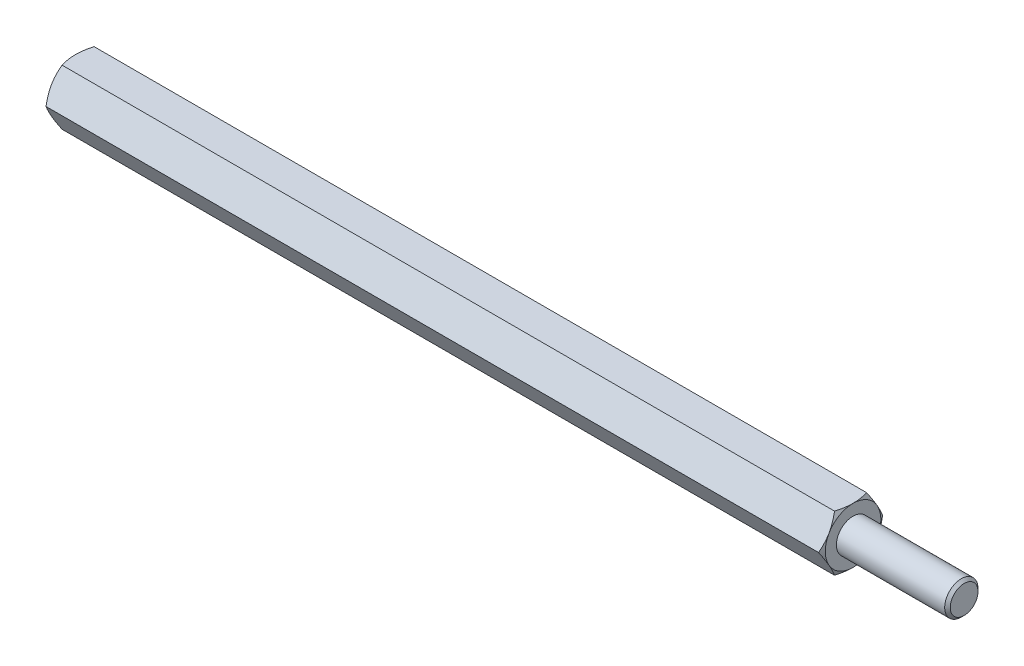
ISO-10303-21;
HEADER;
FILE_DESCRIPTION(('STEP AP214'),'2;1');
FILE_NAME('part.step','',(''),(''),'','','');
FILE_SCHEMA(('AUTOMOTIVE_DESIGN { 1 0 10303 214 1 1 1 1 }'));
ENDSEC;
DATA;
#1=APPLICATION_CONTEXT('core data for automotive mechanical design processes');
#2=APPLICATION_PROTOCOL_DEFINITION('international standard','automotive_design',2000,#1);
#3=PRODUCT_CONTEXT('',#1,'mechanical');
#4=PRODUCT('Part','Part','',(#3));
#5=PRODUCT_RELATED_PRODUCT_CATEGORY('part','',(#4));
#6=PRODUCT_DEFINITION_FORMATION('','',#4);
#7=PRODUCT_DEFINITION_CONTEXT('part definition',#1,'design');
#8=PRODUCT_DEFINITION('design','',#6,#7);
#9=PRODUCT_DEFINITION_SHAPE('','',#8);
#10=(LENGTH_UNIT() NAMED_UNIT(*) SI_UNIT(.MILLI.,.METRE.));
#11=(NAMED_UNIT(*) PLANE_ANGLE_UNIT() SI_UNIT($,.RADIAN.));
#12=(NAMED_UNIT(*) SI_UNIT($,.STERADIAN.) SOLID_ANGLE_UNIT());
#13=UNCERTAINTY_MEASURE_WITH_UNIT(LENGTH_MEASURE(1.E-05),#10,'distance_accuracy_value','');
#14=(GEOMETRIC_REPRESENTATION_CONTEXT(3) GLOBAL_UNCERTAINTY_ASSIGNED_CONTEXT((#13)) GLOBAL_UNIT_ASSIGNED_CONTEXT((#10,
#11,#12)) REPRESENTATION_CONTEXT('',''));
#15=CARTESIAN_POINT('',(0.,0.,0.));
#16=DIRECTION('',(0.,0.,1.));
#17=DIRECTION('',(1.,0.,0.));
#18=AXIS2_PLACEMENT_3D('',#15,#16,#17);
#19=CARTESIAN_POINT('',(35.,2.5,-1.44337567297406));
#20=DIRECTION('',(1.,0.,0.));
#21=DIRECTION('',(0.,0.,-1.));
#22=AXIS2_PLACEMENT_3D('',#19,#20,#21);
#23=PLANE('',#22);
#24=CARTESIAN_POINT('',(35.,0.,0.));
#25=DIRECTION('',(1.,0.,0.));
#26=DIRECTION('',(0.,0.,-1.));
#27=AXIS2_PLACEMENT_3D('',#24,#25,#26);
#28=CIRCLE('',#27,2.50000000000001);
#29=CARTESIAN_POINT('',(35.,-1.25000000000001,-2.16506350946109));
#30=VERTEX_POINT('',#29);
#31=CARTESIAN_POINT('',(35.,1.25,-2.1650635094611));
#32=VERTEX_POINT('',#31);
#33=EDGE_CURVE('E288',#30,#32,#28,.T.);
#34=ORIENTED_EDGE('',*,*,#33,.T.);
#35=CARTESIAN_POINT('',(35.,2.5,0.));
#36=VERTEX_POINT('',#35);
#37=EDGE_CURVE('E53',#32,#36,#28,.T.);
#38=ORIENTED_EDGE('',*,*,#37,.T.);
#39=CARTESIAN_POINT('',(35.,1.25,2.1650635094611));
#40=VERTEX_POINT('',#39);
#41=EDGE_CURVE('E296',#36,#40,#28,.T.);
#42=ORIENTED_EDGE('',*,*,#41,.T.);
#43=CARTESIAN_POINT('',(35.,-1.25000000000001,2.1650635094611));
#44=VERTEX_POINT('',#43);
#45=EDGE_CURVE('E301',#40,#44,#28,.T.);
#46=ORIENTED_EDGE('',*,*,#45,.T.);
#47=CARTESIAN_POINT('',(35.,0.,0.));
#48=DIRECTION('',(-1.,0.,0.));
#49=DIRECTION('',(0.,-1.,0.));
#50=AXIS2_PLACEMENT_3D('',#47,#48,#49);
#51=CIRCLE('',#50,2.50000000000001);
#52=CARTESIAN_POINT('',(35.,-2.50000000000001,0.));
#53=VERTEX_POINT('',#52);
#54=EDGE_CURVE('E193',#53,#44,#51,.T.);
#55=ORIENTED_EDGE('',*,*,#54,.F.);
#56=EDGE_CURVE('E61',#53,#30,#28,.T.);
#57=ORIENTED_EDGE('',*,*,#56,.T.);
#58=EDGE_LOOP('',(#34,#38,#42,#46,#55,#57));
#59=FACE_BOUND('',#58,.T.);
#60=CARTESIAN_POINT('',(35.,0.,0.));
#61=DIRECTION('',(1.,0.,0.));
#62=DIRECTION('',(0.,0.,-1.));
#63=AXIS2_PLACEMENT_3D('',#60,#61,#62);
#64=CIRCLE('',#63,1.5);
#65=CARTESIAN_POINT('',(35.,0.,-1.5));
#66=VERTEX_POINT('',#65);
#67=EDGE_CURVE('E311',#66,#66,#64,.T.);
#68=ORIENTED_EDGE('',*,*,#67,.F.);
#69=EDGE_LOOP('',(#68));
#70=FACE_BOUND('',#69,.T.);
#71=ADVANCED_FACE('F37',(#59,#70),#23,.T.);
#72=CARTESIAN_POINT('',(35.,0.,-2.88675134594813));
#73=DIRECTION('',(0.,-0.5,0.866025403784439));
#74=DIRECTION('',(0.,-0.866025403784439,-0.5));
#75=AXIS2_PLACEMENT_3D('',#72,#73,#74);
#76=PLANE('',#75);
#77=CARTESIAN_POINT('',(34.7766423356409,-0.000199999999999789,-2.88686681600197));
#78=CARTESIAN_POINT('',(34.8132783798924,0.109663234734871,-2.82343724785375));
#79=CARTESIAN_POINT('',(34.846597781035,0.220474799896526,-2.75946016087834));
#80=CARTESIAN_POINT('',(34.9047577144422,0.44401683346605,-2.63039810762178));
#81=CARTESIAN_POINT('',(34.9295776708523,0.556751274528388,-2.5653108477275));
#82=CARTESIAN_POINT('',(34.968214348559,0.780822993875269,-2.43594298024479));
#83=CARTESIAN_POINT('',(34.9822882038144,0.892125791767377,-2.37168227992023));
#84=CARTESIAN_POINT('',(34.9990908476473,1.11525522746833,-2.24285844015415));
#85=CARTESIAN_POINT('',(35.0018335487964,1.22708105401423,-2.17829576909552));
#86=CARTESIAN_POINT('',(34.996134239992,1.43604197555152,-2.05765212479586));
#87=CARTESIAN_POINT('',(34.9890916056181,1.53320831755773,-2.0015531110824));
#88=CARTESIAN_POINT('',(34.9667685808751,1.726907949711,-1.88972057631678));
#89=CARTESIAN_POINT('',(34.9514805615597,1.82344056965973,-1.8339874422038));
#90=CARTESIAN_POINT('',(34.9132609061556,2.01753972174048,-1.7219242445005));
#91=CARTESIAN_POINT('',(34.8901672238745,2.11508168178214,-1.66560836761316));
#92=CARTESIAN_POINT('',(34.8377533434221,2.30871060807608,-1.55381665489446));
#93=CARTESIAN_POINT('',(34.8084454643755,2.40480005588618,-1.49833938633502));
#94=CARTESIAN_POINT('',(34.7766423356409,2.5002,-1.44326020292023));
#95=B_SPLINE_CURVE_WITH_KNOTS('',3,(#77,#78,#79,#80,#81,#82,#83,#84,#85,#86,#87,#88,#89,#90,#91,
#92,#93,#94),.UNSPECIFIED.,.F.,.F.,(4,2,2,2,2,2,2,2,4),(0.,0.396285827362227,0.793524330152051,
1.18093086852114,1.56786160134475,1.90479741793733,2.24204551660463,2.58677531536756,
2.93082800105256),.UNSPECIFIED.);
#96=CARTESIAN_POINT('',(34.7767090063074,0.,-2.88675134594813));
#97=VERTEX_POINT('',#96);
#98=EDGE_CURVE('E317',#97,#32,#95,.T.);
#99=ORIENTED_EDGE('',*,*,#98,.F.);
#100=DIRECTION('',(-1.,0.,0.));
#101=VECTOR('',#100,1.);
#102=CARTESIAN_POINT('',(35.,0.,-2.88675134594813));
#103=LINE('',#102,#101);
#104=CARTESIAN_POINT('',(-34.7767090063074,0.,-2.88675134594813));
#105=VERTEX_POINT('',#104);
#106=EDGE_CURVE('E264',#97,#105,#103,.T.);
#107=ORIENTED_EDGE('',*,*,#106,.T.);
#108=CARTESIAN_POINT('',(-34.7766423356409,2.5002,-1.44326020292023));
#109=CARTESIAN_POINT('',(-34.8132783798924,2.39033676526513,-1.50668977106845));
#110=CARTESIAN_POINT('',(-34.846597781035,2.27952520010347,-1.57066685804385));
#111=CARTESIAN_POINT('',(-34.9047577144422,2.05598316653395,-1.69972891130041));
#112=CARTESIAN_POINT('',(-34.9295776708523,1.94324872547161,-1.7648161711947));
#113=CARTESIAN_POINT('',(-34.968214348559,1.71917700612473,-1.8941840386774));
#114=CARTESIAN_POINT('',(-34.9822882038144,1.60787420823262,-1.95844473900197));
#115=CARTESIAN_POINT('',(-34.9990908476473,1.38474477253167,-2.08726857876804));
#116=CARTESIAN_POINT('',(-35.0018335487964,1.27291894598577,-2.15183124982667));
#117=CARTESIAN_POINT('',(-34.996134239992,1.06395802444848,-2.27247489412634));
#118=CARTESIAN_POINT('',(-34.9890916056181,0.966791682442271,-2.32857390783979));
#119=CARTESIAN_POINT('',(-34.9667685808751,0.773092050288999,-2.44040644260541));
#120=CARTESIAN_POINT('',(-34.9514805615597,0.676559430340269,-2.49613957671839));
#121=CARTESIAN_POINT('',(-34.9132609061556,0.482460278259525,-2.60820277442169));
#122=CARTESIAN_POINT('',(-34.8901672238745,0.384918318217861,-2.66451865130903));
#123=CARTESIAN_POINT('',(-34.8377533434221,0.191289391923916,-2.77631036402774));
#124=CARTESIAN_POINT('',(-34.8084454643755,0.0951999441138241,-2.83178763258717));
#125=CARTESIAN_POINT('',(-34.7766423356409,-0.000199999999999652,-2.88686681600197));
#126=B_SPLINE_CURVE_WITH_KNOTS('',3,(#108,#109,#110,#111,#112,#113,#114,#115,#116,#117,#118,
#119,#120,#121,#122,#123,#124,#125),.UNSPECIFIED.,.F.,.F.,(4,2,2,2,2,2,2,2,4),(0.,
0.396285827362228,0.79352433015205,1.18093086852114,1.56786160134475,1.90479741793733,
2.24204551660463,2.58677531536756,2.93082800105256),.UNSPECIFIED.);
#127=CARTESIAN_POINT('',(-35.,1.25,-2.1650635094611));
#128=VERTEX_POINT('',#127);
#129=EDGE_CURVE('E345',#128,#105,#126,.T.);
#130=ORIENTED_EDGE('',*,*,#129,.F.);
#131=CARTESIAN_POINT('',(-34.7767090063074,2.5,-1.44337567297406));
#132=VERTEX_POINT('',#131);
#133=EDGE_CURVE('E348',#132,#128,#126,.T.);
#134=ORIENTED_EDGE('',*,*,#133,.F.);
#135=DIRECTION('',(-1.,0.,0.));
#136=VECTOR('',#135,1.);
#137=CARTESIAN_POINT('',(35.,2.5,-1.44337567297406));
#138=LINE('',#137,#136);
#139=CARTESIAN_POINT('',(34.7767090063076,2.5,-1.44337567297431));
#140=VERTEX_POINT('',#139);
#141=EDGE_CURVE('E279',#140,#132,#138,.T.);
#142=ORIENTED_EDGE('',*,*,#141,.F.);
#143=EDGE_CURVE('E229',#32,#140,#95,.T.);
#144=ORIENTED_EDGE('',*,*,#143,.F.);
#145=EDGE_LOOP('',(#99,#107,#130,#134,#142,#144));
#146=FACE_BOUND('',#145,.T.);
#147=ADVANCED_FACE('F148',(#146),#76,.F.);
#148=CARTESIAN_POINT('',(35.,2.5,-1.44337567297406));
#149=DIRECTION('',(0.,-1.,0.));
#150=DIRECTION('',(0.,0.,-1.));
#151=AXIS2_PLACEMENT_3D('',#148,#149,#150);
#152=PLANE('',#151);
#153=CARTESIAN_POINT('',(33.7680338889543,2.5,-3.90158441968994));
#154=CARTESIAN_POINT('',(33.8212077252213,2.5,-3.7921700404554));
#155=CARTESIAN_POINT('',(33.8738786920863,2.5,-3.68250707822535));
#156=CARTESIAN_POINT('',(33.9779324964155,2.5,-3.46255185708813));
#157=CARTESIAN_POINT('',(34.0293151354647,2.5,-3.35225950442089));
#158=CARTESIAN_POINT('',(34.1307630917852,2.5,-3.13035696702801));
#159=CARTESIAN_POINT('',(34.1808199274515,2.5,-3.0187428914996));
#160=CARTESIAN_POINT('',(34.2789171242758,2.5,-2.79463535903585));
#161=CARTESIAN_POINT('',(34.3269575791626,2.5,-2.68214194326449));
#162=CARTESIAN_POINT('',(34.4220184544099,2.5,-2.45240385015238));
#163=CARTESIAN_POINT('',(34.4689543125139,2.5,-2.33512399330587));
#164=CARTESIAN_POINT('',(34.5593326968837,2.5,-2.09920133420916));
#165=CARTESIAN_POINT('',(34.6027748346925,2.5,-1.98055838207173));
#166=CARTESIAN_POINT('',(34.6850435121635,2.5,-1.74193489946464));
#167=CARTESIAN_POINT('',(34.7238791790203,2.5,-1.62195754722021));
#168=CARTESIAN_POINT('',(34.7957050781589,2.5,-1.38028205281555));
#169=CARTESIAN_POINT('',(34.8286971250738,2.5,-1.25858445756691));
#170=CARTESIAN_POINT('',(34.8870959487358,2.5,-1.01406369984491));
#171=CARTESIAN_POINT('',(34.9125437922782,2.5,-0.891250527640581));
#172=CARTESIAN_POINT('',(34.9544275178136,2.5,-0.644071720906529));
#173=CARTESIAN_POINT('',(34.9708643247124,2.5,-0.519706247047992));
#174=CARTESIAN_POINT('',(34.9932006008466,2.5,-0.271679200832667));
#175=CARTESIAN_POINT('',(34.9992375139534,2.5,-0.148030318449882));
#176=CARTESIAN_POINT('',(35.0006256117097,2.5,0.0993395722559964));
#177=CARTESIAN_POINT('',(34.9959765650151,2.5,0.22306058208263));
#178=CARTESIAN_POINT('',(34.9794044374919,2.5,0.432351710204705));
#179=CARTESIAN_POINT('',(34.9701066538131,2.5,0.518143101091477));
#180=CARTESIAN_POINT('',(34.9469384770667,2.5,0.689112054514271));
#181=CARTESIAN_POINT('',(34.9330674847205,2.5,0.774289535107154));
#182=CARTESIAN_POINT('',(34.8853202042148,2.5,1.02876599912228));
#183=CARTESIAN_POINT('',(34.8453176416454,2.5,1.19691958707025));
#184=CARTESIAN_POINT('',(34.7522656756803,2.5,1.53362893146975));
#185=CARTESIAN_POINT('',(34.6989362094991,2.5,1.70210423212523));
#186=CARTESIAN_POINT('',(34.6123716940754,2.5,1.95247339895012));
#187=CARTESIAN_POINT('',(34.5824247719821,2.5,2.0355318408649));
#188=CARTESIAN_POINT('',(34.5206840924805,2.5,2.20095860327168));
#189=CARTESIAN_POINT('',(34.4888903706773,2.5,2.28332693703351));
#190=CARTESIAN_POINT('',(34.404014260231,2.5,2.49723312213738));
#191=CARTESIAN_POINT('',(34.3497173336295,2.5,2.62828796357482));
#192=CARTESIAN_POINT('',(34.2381273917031,2.5,2.88912034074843));
#193=CARTESIAN_POINT('',(34.1808341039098,2.5,3.01889775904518));
#194=CARTESIAN_POINT('',(34.0639348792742,2.5,3.27745045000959));
#195=CARTESIAN_POINT('',(34.004328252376,2.5,3.40622540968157));
#196=CARTESIAN_POINT('',(33.8833234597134,2.5,3.6629323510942));
#197=CARTESIAN_POINT('',(33.821925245,2.5,3.79086430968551));
#198=CARTESIAN_POINT('',(33.6354580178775,2.5,4.17399495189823));
#199=CARTESIAN_POINT('',(33.5082824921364,2.5,4.42816724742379));
#200=CARTESIAN_POINT('',(33.2503455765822,2.5,4.9346146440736));
#201=CARTESIAN_POINT('',(33.1195848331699,2.5,5.18689007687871));
#202=CARTESIAN_POINT('',(32.8687100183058,2.5,5.6651245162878));
#203=CARTESIAN_POINT('',(32.7488298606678,2.5,5.89120644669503));
#204=CARTESIAN_POINT('',(32.5075902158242,2.5,6.34259369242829));
#205=CARTESIAN_POINT('',(32.3862306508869,2.5,6.56789896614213));
#206=CARTESIAN_POINT('',(32.142780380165,2.5,7.01722044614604));
#207=CARTESIAN_POINT('',(32.0206930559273,2.5,7.24123848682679));
#208=CARTESIAN_POINT('',(31.7756662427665,2.5,7.68878772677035));
#209=CARTESIAN_POINT('',(31.652726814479,2.5,7.91231895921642));
#210=CARTESIAN_POINT('',(31.5294756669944,2.5,8.1356769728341));
#211=B_SPLINE_CURVE_WITH_KNOTS('',3,(#153,#154,#155,#156,#157,#158,#159,#160,#161,#162,#163,
#164,#165,#166,#167,#168,#169,#170,#171,#172,#173,#174,#175,#176,#177,#178,#179,#180,#181,#182,
#183,#184,#185,#186,#187,#188,#189,#190,#191,#192,#193,#194,#195,#196,#197,#198,#199,#200,#201,
#202,#203,#204,#205,#206,#207,#208,#209,#210),.UNSPECIFIED.,.F.,.F.,(4,2,2,2,2,2,2,2,2,2,2,2,2,
2,2,2,2,2,2,2,2,2,2,2,2,2,2,2,4),(0.,0.364957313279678,0.729970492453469,1.09692930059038,
1.46387103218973,1.84279746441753,2.22176597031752,2.59997058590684,2.97805755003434,
3.3540469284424,3.72999770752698,4.10094071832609,4.47189175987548,4.73064905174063,
4.98944026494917,5.50729076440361,6.037104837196,6.30196454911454,6.56681915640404,
6.99233818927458,7.41789598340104,7.84358170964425,8.26927907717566,9.12186602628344,
9.97430025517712,10.7419897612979,11.509719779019,12.2750964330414,13.0404191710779),.UNSPECIFIED.);
#212=EDGE_CURVE('E227',#140,#36,#211,.T.);
#213=ORIENTED_EDGE('',*,*,#212,.F.);
#214=ORIENTED_EDGE('',*,*,#141,.T.);
#215=CARTESIAN_POINT('',(-33.7680338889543,2.5,-3.90158441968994));
#216=CARTESIAN_POINT('',(-33.8212077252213,2.5,-3.7921700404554));
#217=CARTESIAN_POINT('',(-33.8738786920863,2.5,-3.68250707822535));
#218=CARTESIAN_POINT('',(-33.9779324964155,2.5,-3.46255185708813));
#219=CARTESIAN_POINT('',(-34.0293151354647,2.5,-3.35225950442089));
#220=CARTESIAN_POINT('',(-34.1307630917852,2.5,-3.13035696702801));
#221=CARTESIAN_POINT('',(-34.1808199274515,2.5,-3.0187428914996));
#222=CARTESIAN_POINT('',(-34.2789171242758,2.5,-2.79463535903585));
#223=CARTESIAN_POINT('',(-34.3269575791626,2.5,-2.68214194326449));
#224=CARTESIAN_POINT('',(-34.4220184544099,2.5,-2.45240385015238));
#225=CARTESIAN_POINT('',(-34.4689543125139,2.5,-2.33512399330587));
#226=CARTESIAN_POINT('',(-34.5593326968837,2.5,-2.09920133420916));
#227=CARTESIAN_POINT('',(-34.6027748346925,2.5,-1.98055838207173));
#228=CARTESIAN_POINT('',(-34.6850435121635,2.5,-1.74193489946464));
#229=CARTESIAN_POINT('',(-34.7238791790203,2.5,-1.62195754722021));
#230=CARTESIAN_POINT('',(-34.7957050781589,2.5,-1.38028205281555));
#231=CARTESIAN_POINT('',(-34.8286971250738,2.5,-1.25858445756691));
#232=CARTESIAN_POINT('',(-34.8870959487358,2.5,-1.01406369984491));
#233=CARTESIAN_POINT('',(-34.9125437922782,2.5,-0.891250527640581));
#234=CARTESIAN_POINT('',(-34.9544275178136,2.5,-0.644071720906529));
#235=CARTESIAN_POINT('',(-34.9708643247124,2.5,-0.519706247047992));
#236=CARTESIAN_POINT('',(-34.9932006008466,2.5,-0.271679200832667));
#237=CARTESIAN_POINT('',(-34.9992375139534,2.5,-0.148030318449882));
#238=CARTESIAN_POINT('',(-35.0006256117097,2.5,0.0993395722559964));
#239=CARTESIAN_POINT('',(-34.9959765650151,2.5,0.22306058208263));
#240=CARTESIAN_POINT('',(-34.9794044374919,2.5,0.432351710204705));
#241=CARTESIAN_POINT('',(-34.9701066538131,2.5,0.518143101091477));
#242=CARTESIAN_POINT('',(-34.9469384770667,2.5,0.689112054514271));
#243=CARTESIAN_POINT('',(-34.9330674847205,2.5,0.774289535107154));
#244=CARTESIAN_POINT('',(-34.8853202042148,2.5,1.02876599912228));
#245=CARTESIAN_POINT('',(-34.8453176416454,2.5,1.19691958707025));
#246=CARTESIAN_POINT('',(-34.7522656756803,2.5,1.53362893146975));
#247=CARTESIAN_POINT('',(-34.6989362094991,2.5,1.70210423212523));
#248=CARTESIAN_POINT('',(-34.6123716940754,2.5,1.95247339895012));
#249=CARTESIAN_POINT('',(-34.5824247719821,2.5,2.0355318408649));
#250=CARTESIAN_POINT('',(-34.5206840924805,2.5,2.20095860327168));
#251=CARTESIAN_POINT('',(-34.4888903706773,2.5,2.28332693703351));
#252=CARTESIAN_POINT('',(-34.404014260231,2.5,2.49723312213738));
#253=CARTESIAN_POINT('',(-34.3497173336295,2.5,2.62828796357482));
#254=CARTESIAN_POINT('',(-34.2381273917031,2.5,2.88912034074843));
#255=CARTESIAN_POINT('',(-34.1808341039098,2.5,3.01889775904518));
#256=CARTESIAN_POINT('',(-34.0639348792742,2.5,3.27745045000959));
#257=CARTESIAN_POINT('',(-34.004328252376,2.5,3.40622540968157));
#258=CARTESIAN_POINT('',(-33.8833234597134,2.5,3.6629323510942));
#259=CARTESIAN_POINT('',(-33.821925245,2.5,3.79086430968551));
#260=CARTESIAN_POINT('',(-33.6354580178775,2.5,4.17399495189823));
#261=CARTESIAN_POINT('',(-33.5082824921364,2.5,4.42816724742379));
#262=CARTESIAN_POINT('',(-33.2503455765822,2.5,4.9346146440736));
#263=CARTESIAN_POINT('',(-33.1195848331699,2.5,5.18689007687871));
#264=CARTESIAN_POINT('',(-32.8687100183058,2.5,5.6651245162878));
#265=CARTESIAN_POINT('',(-32.7488298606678,2.5,5.89120644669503));
#266=CARTESIAN_POINT('',(-32.5075902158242,2.5,6.34259369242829));
#267=CARTESIAN_POINT('',(-32.3862306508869,2.5,6.56789896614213));
#268=CARTESIAN_POINT('',(-32.142780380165,2.5,7.01722044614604));
#269=CARTESIAN_POINT('',(-32.0206930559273,2.5,7.24123848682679));
#270=CARTESIAN_POINT('',(-31.7756662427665,2.5,7.68878772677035));
#271=CARTESIAN_POINT('',(-31.652726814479,2.5,7.91231895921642));
#272=CARTESIAN_POINT('',(-31.5294756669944,2.5,8.1356769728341));
#273=B_SPLINE_CURVE_WITH_KNOTS('',3,(#215,#216,#217,#218,#219,#220,#221,#222,#223,#224,#225,
#226,#227,#228,#229,#230,#231,#232,#233,#234,#235,#236,#237,#238,#239,#240,#241,#242,#243,#244,
#245,#246,#247,#248,#249,#250,#251,#252,#253,#254,#255,#256,#257,#258,#259,#260,#261,#262,#263,
#264,#265,#266,#267,#268,#269,#270,#271,#272),.UNSPECIFIED.,.F.,.F.,(4,2,2,2,2,2,2,2,2,2,2,2,2,
2,2,2,2,2,2,2,2,2,2,2,2,2,2,2,4),(0.,0.364957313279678,0.729970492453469,1.09692930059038,
1.46387103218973,1.84279746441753,2.22176597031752,2.59997058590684,2.97805755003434,
3.3540469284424,3.72999770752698,4.10094071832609,4.47189175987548,4.73064905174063,
4.98944026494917,5.50729076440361,6.037104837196,6.30196454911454,6.56681915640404,
6.99233818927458,7.41789598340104,7.84358170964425,8.26927907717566,9.12186602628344,
9.97430025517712,10.7419897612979,11.509719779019,12.2750964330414,13.0404191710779),.UNSPECIFIED.);
#274=CARTESIAN_POINT('',(-35.,2.5,0.));
#275=VERTEX_POINT('',#274);
#276=EDGE_CURVE('E241',#275,#132,#273,.F.);
#277=ORIENTED_EDGE('',*,*,#276,.F.);
#278=CARTESIAN_POINT('',(-34.7767090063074,2.5,1.44337567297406));
#279=VERTEX_POINT('',#278);
#280=EDGE_CURVE('E249',#279,#275,#273,.F.);
#281=ORIENTED_EDGE('',*,*,#280,.F.);
#282=DIRECTION('',(-1.,0.,0.));
#283=VECTOR('',#282,1.);
#284=CARTESIAN_POINT('',(35.,2.5,1.44337567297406));
#285=LINE('',#284,#283);
#286=CARTESIAN_POINT('',(34.7767090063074,2.5,1.44337567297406));
#287=VERTEX_POINT('',#286);
#288=EDGE_CURVE('E276',#287,#279,#285,.T.);
#289=ORIENTED_EDGE('',*,*,#288,.F.);
#290=EDGE_CURVE('E221',#36,#287,#211,.T.);
#291=ORIENTED_EDGE('',*,*,#290,.F.);
#292=EDGE_LOOP('',(#213,#214,#277,#281,#289,#291));
#293=FACE_BOUND('',#292,.T.);
#294=ADVANCED_FACE('F153',(#293),#152,.F.);
#295=CARTESIAN_POINT('',(35.,2.5,1.44337567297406));
#296=DIRECTION('',(0.,-0.5,-0.866025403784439));
#297=DIRECTION('',(0.,0.866025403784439,-0.5));
#298=AXIS2_PLACEMENT_3D('',#295,#296,#297);
#299=PLANE('',#298);
#300=CARTESIAN_POINT('',(34.7766423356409,2.5002,1.44326020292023));
#301=CARTESIAN_POINT('',(34.8132783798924,2.39033676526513,1.50668977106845));
#302=CARTESIAN_POINT('',(34.846597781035,2.27952520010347,1.57066685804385));
#303=CARTESIAN_POINT('',(34.9047577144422,2.05598316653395,1.69972891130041));
#304=CARTESIAN_POINT('',(34.9295776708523,1.94324872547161,1.7648161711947));
#305=CARTESIAN_POINT('',(34.968214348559,1.71917700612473,1.8941840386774));
#306=CARTESIAN_POINT('',(34.9822882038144,1.60787420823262,1.95844473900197));
#307=CARTESIAN_POINT('',(34.9990908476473,1.38474477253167,2.08726857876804));
#308=CARTESIAN_POINT('',(35.0018335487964,1.27291894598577,2.15183124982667));
#309=CARTESIAN_POINT('',(34.996134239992,1.06395802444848,2.27247489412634));
#310=CARTESIAN_POINT('',(34.9890916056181,0.966791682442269,2.32857390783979));
#311=CARTESIAN_POINT('',(34.9667685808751,0.773092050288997,2.44040644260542));
#312=CARTESIAN_POINT('',(34.9514805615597,0.676559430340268,2.4961395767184));
#313=CARTESIAN_POINT('',(34.9132609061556,0.482460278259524,2.60820277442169));
#314=CARTESIAN_POINT('',(34.8901672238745,0.384918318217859,2.66451865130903));
#315=CARTESIAN_POINT('',(34.8377533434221,0.191289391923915,2.77631036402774));
#316=CARTESIAN_POINT('',(34.8084454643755,0.0951999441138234,2.83178763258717));
#317=CARTESIAN_POINT('',(34.7766423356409,-0.000199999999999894,2.88686681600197));
#318=B_SPLINE_CURVE_WITH_KNOTS('',3,(#300,#301,#302,#303,#304,#305,#306,#307,#308,#309,#310,
#311,#312,#313,#314,#315,#316,#317),.UNSPECIFIED.,.F.,.F.,(4,2,2,2,2,2,2,2,4),(0.,
0.396285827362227,0.79352433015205,1.18093086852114,1.56786160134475,1.90479741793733,
2.24204551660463,2.58677531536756,2.93082800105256),.UNSPECIFIED.);
#319=EDGE_CURVE('E228',#287,#40,#318,.T.);
#320=ORIENTED_EDGE('',*,*,#319,.F.);
#321=ORIENTED_EDGE('',*,*,#288,.T.);
#322=CARTESIAN_POINT('',(-34.7766423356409,-0.000200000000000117,2.88686681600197));
#323=CARTESIAN_POINT('',(-34.8132783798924,0.109663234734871,2.82343724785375));
#324=CARTESIAN_POINT('',(-34.846597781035,0.220474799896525,2.75946016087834));
#325=CARTESIAN_POINT('',(-34.9047577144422,0.444016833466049,2.63039810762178));
#326=CARTESIAN_POINT('',(-34.9295776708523,0.556751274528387,2.5653108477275));
#327=CARTESIAN_POINT('',(-34.968214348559,0.780822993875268,2.43594298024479));
#328=CARTESIAN_POINT('',(-34.9822882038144,0.892125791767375,2.37168227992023));
#329=CARTESIAN_POINT('',(-34.9990908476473,1.11525522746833,2.24285844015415));
#330=CARTESIAN_POINT('',(-35.0018335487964,1.22708105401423,2.17829576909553));
#331=CARTESIAN_POINT('',(-34.9961342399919,1.43604197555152,2.05765212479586));
#332=CARTESIAN_POINT('',(-34.9890916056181,1.53320831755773,2.0015531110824));
#333=CARTESIAN_POINT('',(-34.9667685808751,1.726907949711,1.88972057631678));
#334=CARTESIAN_POINT('',(-34.9514805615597,1.82344056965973,1.8339874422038));
#335=CARTESIAN_POINT('',(-34.9132609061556,2.01753972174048,1.7219242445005));
#336=CARTESIAN_POINT('',(-34.8901672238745,2.11508168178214,1.66560836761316));
#337=CARTESIAN_POINT('',(-34.8377533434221,2.30871060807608,1.55381665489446));
#338=CARTESIAN_POINT('',(-34.8084454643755,2.40480005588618,1.49833938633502));
#339=CARTESIAN_POINT('',(-34.7766423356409,2.5002,1.44326020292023));
#340=B_SPLINE_CURVE_WITH_KNOTS('',3,(#322,#323,#324,#325,#326,#327,#328,#329,#330,#331,#332,
#333,#334,#335,#336,#337,#338,#339),.UNSPECIFIED.,.F.,.F.,(4,2,2,2,2,2,2,2,4),(0.,
0.396285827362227,0.79352433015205,1.18093086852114,1.56786160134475,1.90479741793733,
2.24204551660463,2.58677531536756,2.93082800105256),.UNSPECIFIED.);
#341=CARTESIAN_POINT('',(-35.,1.25,2.1650635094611));
#342=VERTEX_POINT('',#341);
#343=EDGE_CURVE('E255',#342,#279,#340,.T.);
#344=ORIENTED_EDGE('',*,*,#343,.F.);
#345=CARTESIAN_POINT('',(-34.7767090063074,0.,2.88675134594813));
#346=VERTEX_POINT('',#345);
#347=EDGE_CURVE('E262',#346,#342,#340,.T.);
#348=ORIENTED_EDGE('',*,*,#347,.F.);
#349=DIRECTION('',(-1.,0.,0.));
#350=VECTOR('',#349,1.);
#351=CARTESIAN_POINT('',(35.,0.,2.88675134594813));
#352=LINE('',#351,#350);
#353=CARTESIAN_POINT('',(34.7767090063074,0.,2.88675134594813));
#354=VERTEX_POINT('',#353);
#355=EDGE_CURVE('E273',#354,#346,#352,.T.);
#356=ORIENTED_EDGE('',*,*,#355,.F.);
#357=EDGE_CURVE('E215',#40,#354,#318,.T.);
#358=ORIENTED_EDGE('',*,*,#357,.F.);
#359=EDGE_LOOP('',(#320,#321,#344,#348,#356,#358));
#360=FACE_BOUND('',#359,.T.);
#361=ADVANCED_FACE('F235',(#360),#299,.F.);
#362=CARTESIAN_POINT('',(35.,0.,2.88675134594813));
#363=DIRECTION('',(0.,0.5,-0.866025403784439));
#364=DIRECTION('',(0.,0.866025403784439,0.5));
#365=AXIS2_PLACEMENT_3D('',#362,#363,#364);
#366=PLANE('',#365);
#367=CARTESIAN_POINT('',(34.7766423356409,0.000200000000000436,2.88686681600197));
#368=CARTESIAN_POINT('',(34.8132783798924,-0.10966323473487,2.82343724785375));
#369=CARTESIAN_POINT('',(34.846597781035,-0.220474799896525,2.75946016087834));
#370=CARTESIAN_POINT('',(34.9047577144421,-0.444016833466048,2.63039810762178));
#371=CARTESIAN_POINT('',(34.9295776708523,-0.556751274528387,2.5653108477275));
#372=CARTESIAN_POINT('',(34.968214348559,-0.780822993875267,2.43594298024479));
#373=CARTESIAN_POINT('',(34.9822882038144,-0.892125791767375,2.37168227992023));
#374=CARTESIAN_POINT('',(34.9990908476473,-1.11525522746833,2.24285844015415));
#375=CARTESIAN_POINT('',(35.0018335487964,-1.22708105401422,2.17829576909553));
#376=CARTESIAN_POINT('',(34.996134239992,-1.43604197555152,2.05765212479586));
#377=CARTESIAN_POINT('',(34.9890916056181,-1.53320831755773,2.0015531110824));
#378=CARTESIAN_POINT('',(34.9667685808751,-1.726907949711,1.88972057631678));
#379=CARTESIAN_POINT('',(34.9514805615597,-1.82344056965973,1.8339874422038));
#380=CARTESIAN_POINT('',(34.9132609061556,-2.01753972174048,1.7219242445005));
#381=CARTESIAN_POINT('',(34.8901672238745,-2.11508168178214,1.66560836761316));
#382=CARTESIAN_POINT('',(34.8377533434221,-2.30871060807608,1.55381665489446));
#383=CARTESIAN_POINT('',(34.8084454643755,-2.40480005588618,1.49833938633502));
#384=CARTESIAN_POINT('',(34.7766423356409,-2.5002,1.44326020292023));
#385=B_SPLINE_CURVE_WITH_KNOTS('',3,(#367,#368,#369,#370,#371,#372,#373,#374,#375,#376,#377,
#378,#379,#380,#381,#382,#383,#384),.UNSPECIFIED.,.F.,.F.,(4,2,2,2,2,2,2,2,4),(0.,
0.396285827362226,0.793524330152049,1.18093086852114,1.56786160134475,1.90479741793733,
2.24204551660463,2.58677531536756,2.93082800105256),.UNSPECIFIED.);
#386=EDGE_CURVE('E321',#354,#44,#385,.T.);
#387=ORIENTED_EDGE('',*,*,#386,.F.);
#388=ORIENTED_EDGE('',*,*,#355,.T.);
#389=CARTESIAN_POINT('',(-34.7766423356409,-2.5002,1.44326020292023));
#390=CARTESIAN_POINT('',(-34.8132783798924,-2.39033676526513,1.50668977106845));
#391=CARTESIAN_POINT('',(-34.846597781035,-2.27952520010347,1.57066685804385));
#392=CARTESIAN_POINT('',(-34.9047577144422,-2.05598316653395,1.69972891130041));
#393=CARTESIAN_POINT('',(-34.9295776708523,-1.94324872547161,1.76481617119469));
#394=CARTESIAN_POINT('',(-34.968214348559,-1.71917700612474,1.8941840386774));
#395=CARTESIAN_POINT('',(-34.9822882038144,-1.60787420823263,1.95844473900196));
#396=CARTESIAN_POINT('',(-34.9990908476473,-1.38474477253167,2.08726857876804));
#397=CARTESIAN_POINT('',(-35.0018335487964,-1.27291894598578,2.15183124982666));
#398=CARTESIAN_POINT('',(-34.996134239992,-1.06395802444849,2.27247489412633));
#399=CARTESIAN_POINT('',(-34.9890916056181,-0.966791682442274,2.32857390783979));
#400=CARTESIAN_POINT('',(-34.9667685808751,-0.773092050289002,2.44040644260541));
#401=CARTESIAN_POINT('',(-34.9514805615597,-0.676559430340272,2.49613957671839));
#402=CARTESIAN_POINT('',(-34.9132609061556,-0.482460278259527,2.60820277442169));
#403=CARTESIAN_POINT('',(-34.8901672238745,-0.384918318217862,2.66451865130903));
#404=CARTESIAN_POINT('',(-34.8377533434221,-0.191289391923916,2.77631036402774));
#405=CARTESIAN_POINT('',(-34.8084454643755,-0.0951999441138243,2.83178763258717));
#406=CARTESIAN_POINT('',(-34.7766423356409,0.000200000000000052,2.88686681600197));
#407=B_SPLINE_CURVE_WITH_KNOTS('',3,(#389,#390,#391,#392,#393,#394,#395,#396,#397,#398,#399,
#400,#401,#402,#403,#404,#405,#406),.UNSPECIFIED.,.F.,.F.,(4,2,2,2,2,2,2,2,4),(0.,
0.396285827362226,0.793524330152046,1.18093086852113,1.56786160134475,1.90479741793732,
2.24204551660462,2.58677531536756,2.93082800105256),.UNSPECIFIED.);
#408=CARTESIAN_POINT('',(-35.,-1.25000000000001,2.1650635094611));
#409=VERTEX_POINT('',#408);
#410=EDGE_CURVE('E263',#409,#346,#407,.T.);
#411=ORIENTED_EDGE('',*,*,#410,.F.);
#412=CARTESIAN_POINT('',(-34.7767090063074,-2.5,1.44337567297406));
#413=VERTEX_POINT('',#412);
#414=EDGE_CURVE('E250',#413,#409,#407,.T.);
#415=ORIENTED_EDGE('',*,*,#414,.F.);
#416=DIRECTION('',(-1.,0.,0.));
#417=VECTOR('',#416,1.);
#418=CARTESIAN_POINT('',(35.,-2.5,1.44337567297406));
#419=LINE('',#418,#417);
#420=CARTESIAN_POINT('',(34.7767090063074,-2.5,1.44337567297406));
#421=VERTEX_POINT('',#420);
#422=EDGE_CURVE('E270',#421,#413,#419,.T.);
#423=ORIENTED_EDGE('',*,*,#422,.F.);
#424=EDGE_CURVE('E210',#44,#421,#385,.T.);
#425=ORIENTED_EDGE('',*,*,#424,.F.);
#426=EDGE_LOOP('',(#387,#388,#411,#415,#423,#425));
#427=FACE_BOUND('',#426,.T.);
#428=ADVANCED_FACE('F408',(#427),#366,.F.);
#429=CARTESIAN_POINT('',(35.,-2.5,1.44337567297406));
#430=DIRECTION('',(0.,1.,0.));
#431=DIRECTION('',(0.,0.,1.));
#432=AXIS2_PLACEMENT_3D('',#429,#430,#431);
#433=PLANE('',#432);
#434=CARTESIAN_POINT('',(33.7680338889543,-2.5,-3.90158441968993));
#435=CARTESIAN_POINT('',(33.8212077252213,-2.5,-3.79217004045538));
#436=CARTESIAN_POINT('',(33.8738786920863,-2.5,-3.68250707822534));
#437=CARTESIAN_POINT('',(33.9779324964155,-2.5,-3.46255185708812));
#438=CARTESIAN_POINT('',(34.0293151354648,-2.5,-3.35225950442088));
#439=CARTESIAN_POINT('',(34.1307630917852,-2.5,-3.130356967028));
#440=CARTESIAN_POINT('',(34.1808199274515,-2.5,-3.01874289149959));
#441=CARTESIAN_POINT('',(34.2789171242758,-2.5,-2.79463535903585));
#442=CARTESIAN_POINT('',(34.3269575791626,-2.5,-2.68214194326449));
#443=CARTESIAN_POINT('',(34.4220184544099,-2.5,-2.45240385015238));
#444=CARTESIAN_POINT('',(34.4689543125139,-2.5,-2.33512399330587));
#445=CARTESIAN_POINT('',(34.5593326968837,-2.5,-2.09920133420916));
#446=CARTESIAN_POINT('',(34.6027748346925,-2.5,-1.98055838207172));
#447=CARTESIAN_POINT('',(34.6850435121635,-2.5,-1.74193489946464));
#448=CARTESIAN_POINT('',(34.7238791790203,-2.5,-1.6219575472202));
#449=CARTESIAN_POINT('',(34.7957050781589,-2.5,-1.38028205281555));
#450=CARTESIAN_POINT('',(34.8286971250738,-2.5,-1.25858445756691));
#451=CARTESIAN_POINT('',(34.8870959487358,-2.5,-1.01406369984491));
#452=CARTESIAN_POINT('',(34.9125437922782,-2.5,-0.891250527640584));
#453=CARTESIAN_POINT('',(34.9544275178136,-2.5,-0.644071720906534));
#454=CARTESIAN_POINT('',(34.9708643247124,-2.5,-0.519706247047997));
#455=CARTESIAN_POINT('',(34.9932006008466,-2.5,-0.271679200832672));
#456=CARTESIAN_POINT('',(34.9992375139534,-2.5,-0.148030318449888));
#457=CARTESIAN_POINT('',(35.0006256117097,-2.5,0.0993395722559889));
#458=CARTESIAN_POINT('',(34.9959765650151,-2.5,0.223060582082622));
#459=CARTESIAN_POINT('',(34.979404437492,-2.5,0.432351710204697));
#460=CARTESIAN_POINT('',(34.9701066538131,-2.5,0.518143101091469));
#461=CARTESIAN_POINT('',(34.9469384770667,-2.5,0.689112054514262));
#462=CARTESIAN_POINT('',(34.9330674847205,-2.5,0.774289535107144));
#463=CARTESIAN_POINT('',(34.8853202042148,-2.5,1.02876599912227));
#464=CARTESIAN_POINT('',(34.8453176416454,-2.5,1.19691958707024));
#465=CARTESIAN_POINT('',(34.7522656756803,-2.5,1.53362893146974));
#466=CARTESIAN_POINT('',(34.6989362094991,-2.5,1.70210423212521));
#467=CARTESIAN_POINT('',(34.6123716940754,-2.5,1.95247339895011));
#468=CARTESIAN_POINT('',(34.5824247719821,-2.5,2.03553184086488));
#469=CARTESIAN_POINT('',(34.5206840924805,-2.5,2.20095860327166));
#470=CARTESIAN_POINT('',(34.4888903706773,-2.5,2.28332693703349));
#471=CARTESIAN_POINT('',(34.404014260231,-2.5,2.49723312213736));
#472=CARTESIAN_POINT('',(34.3497173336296,-2.5,2.62828796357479));
#473=CARTESIAN_POINT('',(34.2381273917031,-2.5,2.8891203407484));
#474=CARTESIAN_POINT('',(34.1808341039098,-2.5,3.01889775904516));
#475=CARTESIAN_POINT('',(34.0639348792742,-2.5,3.27745045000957));
#476=CARTESIAN_POINT('',(34.004328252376,-2.5,3.40622540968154));
#477=CARTESIAN_POINT('',(33.8833234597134,-2.5,3.66293235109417));
#478=CARTESIAN_POINT('',(33.821925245,-2.5,3.79086430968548));
#479=CARTESIAN_POINT('',(33.6354580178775,-2.5,4.17399495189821));
#480=CARTESIAN_POINT('',(33.5082824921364,-2.5,4.42816724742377));
#481=CARTESIAN_POINT('',(33.2503455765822,-2.5,4.93461464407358));
#482=CARTESIAN_POINT('',(33.1195848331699,-2.5,5.18689007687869));
#483=CARTESIAN_POINT('',(32.8687100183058,-2.5,5.66512451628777));
#484=CARTESIAN_POINT('',(32.7488298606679,-2.5,5.89120644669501));
#485=CARTESIAN_POINT('',(32.5075902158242,-2.5,6.34259369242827));
#486=CARTESIAN_POINT('',(32.3862306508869,-2.5,6.5678989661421));
#487=CARTESIAN_POINT('',(32.142780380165,-2.5,7.01722044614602));
#488=CARTESIAN_POINT('',(32.0206930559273,-2.5,7.24123848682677));
#489=CARTESIAN_POINT('',(31.7756662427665,-2.5,7.68878772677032));
#490=CARTESIAN_POINT('',(31.652726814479,-2.5,7.9123189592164));
#491=CARTESIAN_POINT('',(31.5294756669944,-2.5,8.13567697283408));
#492=B_SPLINE_CURVE_WITH_KNOTS('',3,(#434,#435,#436,#437,#438,#439,#440,#441,#442,#443,#444,
#445,#446,#447,#448,#449,#450,#451,#452,#453,#454,#455,#456,#457,#458,#459,#460,#461,#462,#463,
#464,#465,#466,#467,#468,#469,#470,#471,#472,#473,#474,#475,#476,#477,#478,#479,#480,#481,#482,
#483,#484,#485,#486,#487,#488,#489,#490,#491),.UNSPECIFIED.,.F.,.F.,(4,2,2,2,2,2,2,2,2,2,2,2,2,
2,2,2,2,2,2,2,2,2,2,2,2,2,2,2,4),(0.,0.364957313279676,0.729970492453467,1.09692930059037,
1.46387103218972,1.84279746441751,2.22176597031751,2.59997058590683,2.97805755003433,
3.35404692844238,3.72999770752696,4.10094071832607,4.47189175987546,4.73064905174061,
4.98944026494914,5.50729076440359,6.03710483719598,6.30196454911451,6.566819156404,
6.99233818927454,7.417895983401,7.84358170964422,8.26927907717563,9.1218660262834,
9.97430025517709,10.7419897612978,11.5097197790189,12.2750964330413,13.0404191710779),.UNSPECIFIED.);
#493=EDGE_CURVE('E325',#421,#53,#492,.F.);
#494=ORIENTED_EDGE('',*,*,#493,.F.);
#495=ORIENTED_EDGE('',*,*,#422,.T.);
#496=CARTESIAN_POINT('',(-33.7680338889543,-2.5,-3.90158441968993));
#497=CARTESIAN_POINT('',(-33.8212077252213,-2.5,-3.79217004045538));
#498=CARTESIAN_POINT('',(-33.8738786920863,-2.5,-3.68250707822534));
#499=CARTESIAN_POINT('',(-33.9779324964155,-2.5,-3.46255185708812));
#500=CARTESIAN_POINT('',(-34.0293151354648,-2.5,-3.35225950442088));
#501=CARTESIAN_POINT('',(-34.1307630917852,-2.5,-3.130356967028));
#502=CARTESIAN_POINT('',(-34.1808199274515,-2.5,-3.01874289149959));
#503=CARTESIAN_POINT('',(-34.2789171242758,-2.5,-2.79463535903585));
#504=CARTESIAN_POINT('',(-34.3269575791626,-2.5,-2.68214194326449));
#505=CARTESIAN_POINT('',(-34.4220184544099,-2.5,-2.45240385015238));
#506=CARTESIAN_POINT('',(-34.4689543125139,-2.5,-2.33512399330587));
#507=CARTESIAN_POINT('',(-34.5593326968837,-2.5,-2.09920133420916));
#508=CARTESIAN_POINT('',(-34.6027748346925,-2.5,-1.98055838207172));
#509=CARTESIAN_POINT('',(-34.6850435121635,-2.5,-1.74193489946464));
#510=CARTESIAN_POINT('',(-34.7238791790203,-2.5,-1.6219575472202));
#511=CARTESIAN_POINT('',(-34.7957050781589,-2.5,-1.38028205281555));
#512=CARTESIAN_POINT('',(-34.8286971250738,-2.5,-1.25858445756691));
#513=CARTESIAN_POINT('',(-34.8870959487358,-2.5,-1.01406369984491));
#514=CARTESIAN_POINT('',(-34.9125437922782,-2.5,-0.891250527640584));
#515=CARTESIAN_POINT('',(-34.9544275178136,-2.5,-0.644071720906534));
#516=CARTESIAN_POINT('',(-34.9708643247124,-2.5,-0.519706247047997));
#517=CARTESIAN_POINT('',(-34.9932006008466,-2.5,-0.271679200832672));
#518=CARTESIAN_POINT('',(-34.9992375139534,-2.5,-0.148030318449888));
#519=CARTESIAN_POINT('',(-35.0006256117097,-2.5,0.0993395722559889));
#520=CARTESIAN_POINT('',(-34.9959765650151,-2.5,0.223060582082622));
#521=CARTESIAN_POINT('',(-34.979404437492,-2.5,0.432351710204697));
#522=CARTESIAN_POINT('',(-34.9701066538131,-2.5,0.518143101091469));
#523=CARTESIAN_POINT('',(-34.9469384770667,-2.5,0.689112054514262));
#524=CARTESIAN_POINT('',(-34.9330674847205,-2.5,0.774289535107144));
#525=CARTESIAN_POINT('',(-34.8853202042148,-2.5,1.02876599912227));
#526=CARTESIAN_POINT('',(-34.8453176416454,-2.5,1.19691958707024));
#527=CARTESIAN_POINT('',(-34.7522656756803,-2.5,1.53362893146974));
#528=CARTESIAN_POINT('',(-34.6989362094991,-2.5,1.70210423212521));
#529=CARTESIAN_POINT('',(-34.6123716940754,-2.5,1.95247339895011));
#530=CARTESIAN_POINT('',(-34.5824247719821,-2.5,2.03553184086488));
#531=CARTESIAN_POINT('',(-34.5206840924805,-2.5,2.20095860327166));
#532=CARTESIAN_POINT('',(-34.4888903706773,-2.5,2.28332693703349));
#533=CARTESIAN_POINT('',(-34.404014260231,-2.5,2.49723312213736));
#534=CARTESIAN_POINT('',(-34.3497173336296,-2.5,2.62828796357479));
#535=CARTESIAN_POINT('',(-34.2381273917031,-2.5,2.8891203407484));
#536=CARTESIAN_POINT('',(-34.1808341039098,-2.5,3.01889775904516));
#537=CARTESIAN_POINT('',(-34.0639348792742,-2.5,3.27745045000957));
#538=CARTESIAN_POINT('',(-34.004328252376,-2.5,3.40622540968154));
#539=CARTESIAN_POINT('',(-33.8833234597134,-2.5,3.66293235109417));
#540=CARTESIAN_POINT('',(-33.821925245,-2.5,3.79086430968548));
#541=CARTESIAN_POINT('',(-33.6354580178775,-2.5,4.17399495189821));
#542=CARTESIAN_POINT('',(-33.5082824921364,-2.5,4.42816724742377));
#543=CARTESIAN_POINT('',(-33.2503455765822,-2.5,4.93461464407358));
#544=CARTESIAN_POINT('',(-33.1195848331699,-2.5,5.18689007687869));
#545=CARTESIAN_POINT('',(-32.8687100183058,-2.5,5.66512451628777));
#546=CARTESIAN_POINT('',(-32.7488298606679,-2.5,5.89120644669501));
#547=CARTESIAN_POINT('',(-32.5075902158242,-2.5,6.34259369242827));
#548=CARTESIAN_POINT('',(-32.3862306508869,-2.5,6.5678989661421));
#549=CARTESIAN_POINT('',(-32.142780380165,-2.5,7.01722044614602));
#550=CARTESIAN_POINT('',(-32.0206930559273,-2.5,7.24123848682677));
#551=CARTESIAN_POINT('',(-31.7756662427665,-2.5,7.68878772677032));
#552=CARTESIAN_POINT('',(-31.652726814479,-2.5,7.9123189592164));
#553=CARTESIAN_POINT('',(-31.5294756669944,-2.5,8.13567697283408));
#554=B_SPLINE_CURVE_WITH_KNOTS('',3,(#496,#497,#498,#499,#500,#501,#502,#503,#504,#505,#506,
#507,#508,#509,#510,#511,#512,#513,#514,#515,#516,#517,#518,#519,#520,#521,#522,#523,#524,#525,
#526,#527,#528,#529,#530,#531,#532,#533,#534,#535,#536,#537,#538,#539,#540,#541,#542,#543,#544,
#545,#546,#547,#548,#549,#550,#551,#552,#553),.UNSPECIFIED.,.F.,.F.,(4,2,2,2,2,2,2,2,2,2,2,2,2,
2,2,2,2,2,2,2,2,2,2,2,2,2,2,2,4),(0.,0.364957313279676,0.729970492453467,1.09692930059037,
1.46387103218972,1.84279746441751,2.22176597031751,2.59997058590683,2.97805755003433,
3.35404692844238,3.72999770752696,4.10094071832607,4.47189175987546,4.73064905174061,
4.98944026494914,5.50729076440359,6.03710483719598,6.30196454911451,6.566819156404,
6.99233818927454,7.417895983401,7.84358170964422,8.26927907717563,9.1218660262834,
9.97430025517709,10.7419897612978,11.5097197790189,12.2750964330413,13.0404191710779),.UNSPECIFIED.);
#555=CARTESIAN_POINT('',(-35.,-2.50000000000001,0.));
#556=VERTEX_POINT('',#555);
#557=EDGE_CURVE('E328',#556,#413,#554,.T.);
#558=ORIENTED_EDGE('',*,*,#557,.F.);
#559=CARTESIAN_POINT('',(-34.7767090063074,-2.5,-1.44337567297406));
#560=VERTEX_POINT('',#559);
#561=EDGE_CURVE('E338',#560,#556,#554,.T.);
#562=ORIENTED_EDGE('',*,*,#561,.F.);
#563=DIRECTION('',(-1.,0.,0.));
#564=VECTOR('',#563,1.);
#565=CARTESIAN_POINT('',(35.,-2.5,-1.44337567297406));
#566=LINE('',#565,#564);
#567=CARTESIAN_POINT('',(34.7767090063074,-2.5,-1.44337567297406));
#568=VERTEX_POINT('',#567);
#569=EDGE_CURVE('E267',#568,#560,#566,.T.);
#570=ORIENTED_EDGE('',*,*,#569,.F.);
#571=EDGE_CURVE('E195',#53,#568,#492,.F.);
#572=ORIENTED_EDGE('',*,*,#571,.F.);
#573=EDGE_LOOP('',(#494,#495,#558,#562,#570,#572));
#574=FACE_BOUND('',#573,.T.);
#575=ADVANCED_FACE('F172',(#574),#433,.F.);
#576=CARTESIAN_POINT('',(35.,-2.5,-1.44337567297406));
#577=DIRECTION('',(0.,0.5,0.866025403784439));
#578=DIRECTION('',(0.,-0.866025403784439,0.5));
#579=AXIS2_PLACEMENT_3D('',#576,#577,#578);
#580=PLANE('',#579);
#581=CARTESIAN_POINT('',(34.7766423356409,-2.5002,-1.44326020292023));
#582=CARTESIAN_POINT('',(34.8132783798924,-2.39033676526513,-1.50668977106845));
#583=CARTESIAN_POINT('',(34.846597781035,-2.27952520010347,-1.57066685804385));
#584=CARTESIAN_POINT('',(34.9047577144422,-2.05598316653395,-1.69972891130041));
#585=CARTESIAN_POINT('',(34.9295776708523,-1.94324872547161,-1.76481617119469));
#586=CARTESIAN_POINT('',(34.968214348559,-1.71917700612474,-1.8941840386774));
#587=CARTESIAN_POINT('',(34.9822882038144,-1.60787420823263,-1.95844473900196));
#588=CARTESIAN_POINT('',(34.9990908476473,-1.38474477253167,-2.08726857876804));
#589=CARTESIAN_POINT('',(35.0018335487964,-1.27291894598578,-2.15183124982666));
#590=CARTESIAN_POINT('',(34.996134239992,-1.06395802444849,-2.27247489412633));
#591=CARTESIAN_POINT('',(34.9890916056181,-0.966791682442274,-2.32857390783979));
#592=CARTESIAN_POINT('',(34.9667685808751,-0.773092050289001,-2.44040644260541));
#593=CARTESIAN_POINT('',(34.9514805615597,-0.676559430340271,-2.49613957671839));
#594=CARTESIAN_POINT('',(34.9132609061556,-0.482460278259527,-2.60820277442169));
#595=CARTESIAN_POINT('',(34.8901672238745,-0.384918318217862,-2.66451865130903));
#596=CARTESIAN_POINT('',(34.8377533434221,-0.191289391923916,-2.77631036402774));
#597=CARTESIAN_POINT('',(34.8084454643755,-0.0951999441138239,-2.83178763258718));
#598=CARTESIAN_POINT('',(34.7766423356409,0.000200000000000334,-2.88686681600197));
#599=B_SPLINE_CURVE_WITH_KNOTS('',3,(#581,#582,#583,#584,#585,#586,#587,#588,#589,#590,#591,
#592,#593,#594,#595,#596,#597,#598),.UNSPECIFIED.,.F.,.F.,(4,2,2,2,2,2,2,2,4),(0.,
0.396285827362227,0.793524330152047,1.18093086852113,1.56786160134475,1.90479741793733,
2.24204551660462,2.58677531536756,2.93082800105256),.UNSPECIFIED.);
#600=EDGE_CURVE('E192',#568,#30,#599,.T.);
#601=ORIENTED_EDGE('',*,*,#600,.F.);
#602=ORIENTED_EDGE('',*,*,#569,.T.);
#603=CARTESIAN_POINT('',(-34.7766423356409,0.000200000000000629,-2.88686681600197));
#604=CARTESIAN_POINT('',(-34.8132783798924,-0.10966323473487,-2.82343724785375));
#605=CARTESIAN_POINT('',(-34.846597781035,-0.220474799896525,-2.75946016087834));
#606=CARTESIAN_POINT('',(-34.9047577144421,-0.444016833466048,-2.63039810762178));
#607=CARTESIAN_POINT('',(-34.9295776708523,-0.556751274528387,-2.5653108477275));
#608=CARTESIAN_POINT('',(-34.968214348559,-0.780822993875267,-2.43594298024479));
#609=CARTESIAN_POINT('',(-34.9822882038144,-0.892125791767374,-2.37168227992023));
#610=CARTESIAN_POINT('',(-34.9990908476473,-1.11525522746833,-2.24285844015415));
#611=CARTESIAN_POINT('',(-35.0018335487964,-1.22708105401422,-2.17829576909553));
#612=CARTESIAN_POINT('',(-34.996134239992,-1.43604197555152,-2.05765212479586));
#613=CARTESIAN_POINT('',(-34.9890916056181,-1.53320831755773,-2.0015531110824));
#614=CARTESIAN_POINT('',(-34.9667685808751,-1.726907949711,-1.88972057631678));
#615=CARTESIAN_POINT('',(-34.9514805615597,-1.82344056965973,-1.8339874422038));
#616=CARTESIAN_POINT('',(-34.9132609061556,-2.01753972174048,-1.7219242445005));
#617=CARTESIAN_POINT('',(-34.8901672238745,-2.11508168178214,-1.66560836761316));
#618=CARTESIAN_POINT('',(-34.8377533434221,-2.30871060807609,-1.55381665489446));
#619=CARTESIAN_POINT('',(-34.8084454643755,-2.40480005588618,-1.49833938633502));
#620=CARTESIAN_POINT('',(-34.7766423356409,-2.5002,-1.44326020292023));
#621=B_SPLINE_CURVE_WITH_KNOTS('',3,(#603,#604,#605,#606,#607,#608,#609,#610,#611,#612,#613,
#614,#615,#616,#617,#618,#619,#620),.UNSPECIFIED.,.F.,.F.,(4,2,2,2,2,2,2,2,4),(0.,
0.396285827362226,0.793524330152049,1.18093086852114,1.56786160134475,1.90479741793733,
2.24204551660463,2.58677531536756,2.93082800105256),.UNSPECIFIED.);
#622=CARTESIAN_POINT('',(-35.,-1.25000000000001,-2.16506350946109));
#623=VERTEX_POINT('',#622);
#624=EDGE_CURVE('E178',#623,#560,#621,.T.);
#625=ORIENTED_EDGE('',*,*,#624,.F.);
#626=EDGE_CURVE('E335',#105,#623,#621,.T.);
#627=ORIENTED_EDGE('',*,*,#626,.F.);
#628=ORIENTED_EDGE('',*,*,#106,.F.);
#629=EDGE_CURVE('E185',#30,#97,#599,.T.);
#630=ORIENTED_EDGE('',*,*,#629,.F.);
#631=EDGE_LOOP('',(#601,#602,#625,#627,#628,#630));
#632=FACE_BOUND('',#631,.T.);
#633=ADVANCED_FACE('F167',(#632),#580,.F.);
#634=CARTESIAN_POINT('',(-35.,0.,0.));
#635=DIRECTION('',(1.,0.,0.));
#636=DIRECTION('',(0.,1.,0.));
#637=AXIS2_PLACEMENT_3D('',#634,#635,#636);
#638=CONICAL_SURFACE('',#637,2.50000000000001,1.0471975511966);
#639=ORIENTED_EDGE('',*,*,#129,.T.);
#640=ORIENTED_EDGE('',*,*,#626,.T.);
#641=CARTESIAN_POINT('',(-35.,0.,0.));
#642=DIRECTION('',(1.,0.,0.));
#643=DIRECTION('',(0.,0.,-1.));
#644=AXIS2_PLACEMENT_3D('',#641,#642,#643);
#645=CIRCLE('',#644,2.50000000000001);
#646=EDGE_CURVE('E282',#623,#128,#645,.T.);
#647=ORIENTED_EDGE('',*,*,#646,.T.);
#648=EDGE_LOOP('',(#639,#640,#647));
#649=FACE_BOUND('',#648,.T.);
#650=ADVANCED_FACE('F171',(#649),#638,.T.);
#651=ORIENTED_EDGE('',*,*,#561,.T.);
#652=EDGE_CURVE('E286',#556,#623,#645,.T.);
#653=ORIENTED_EDGE('',*,*,#652,.T.);
#654=ORIENTED_EDGE('',*,*,#624,.T.);
#655=EDGE_LOOP('',(#651,#653,#654));
#656=FACE_BOUND('',#655,.T.);
#657=ADVANCED_FACE('F391',(#656),#638,.T.);
#658=ORIENTED_EDGE('',*,*,#414,.T.);
#659=CARTESIAN_POINT('',(-35.,0.,0.));
#660=DIRECTION('',(-1.,0.,0.));
#661=DIRECTION('',(0.,-1.,0.));
#662=AXIS2_PLACEMENT_3D('',#659,#660,#661);
#663=CIRCLE('',#662,2.50000000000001);
#664=EDGE_CURVE('E329',#556,#409,#663,.T.);
#665=ORIENTED_EDGE('',*,*,#664,.F.);
#666=ORIENTED_EDGE('',*,*,#557,.T.);
#667=EDGE_LOOP('',(#658,#665,#666));
#668=FACE_BOUND('',#667,.T.);
#669=ADVANCED_FACE('F404',(#668),#638,.T.);
#670=ORIENTED_EDGE('',*,*,#347,.T.);
#671=EDGE_CURVE('E333',#342,#409,#645,.T.);
#672=ORIENTED_EDGE('',*,*,#671,.T.);
#673=ORIENTED_EDGE('',*,*,#410,.T.);
#674=EDGE_LOOP('',(#670,#672,#673));
#675=FACE_BOUND('',#674,.T.);
#676=ADVANCED_FACE('F158',(#675),#638,.T.);
#677=ORIENTED_EDGE('',*,*,#343,.T.);
#678=ORIENTED_EDGE('',*,*,#280,.T.);
#679=EDGE_CURVE('E352',#275,#342,#645,.T.);
#680=ORIENTED_EDGE('',*,*,#679,.T.);
#681=EDGE_LOOP('',(#677,#678,#680));
#682=FACE_BOUND('',#681,.T.);
#683=ADVANCED_FACE('F418',(#682),#638,.T.);
#684=ORIENTED_EDGE('',*,*,#276,.T.);
#685=ORIENTED_EDGE('',*,*,#133,.T.);
#686=EDGE_CURVE('E287',#128,#275,#645,.T.);
#687=ORIENTED_EDGE('',*,*,#686,.T.);
#688=EDGE_LOOP('',(#684,#685,#687));
#689=FACE_BOUND('',#688,.T.);
#690=ADVANCED_FACE('F165',(#689),#638,.T.);
#691=CARTESIAN_POINT('',(-35.,2.5,-1.44337567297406));
#692=DIRECTION('',(1.,0.,0.));
#693=DIRECTION('',(0.,0.,-1.));
#694=AXIS2_PLACEMENT_3D('',#691,#692,#693);
#695=PLANE('',#694);
#696=CARTESIAN_POINT('',(-35.,0.,0.));
#697=DIRECTION('',(-1.,0.,0.));
#698=DIRECTION('',(0.,0.,1.));
#699=AXIS2_PLACEMENT_3D('',#696,#697,#698);
#700=CIRCLE('',#699,1.25);
#701=CARTESIAN_POINT('',(-35.,0.,1.25));
#702=VERTEX_POINT('',#701);
#703=EDGE_CURVE('E315',#702,#702,#700,.T.);
#704=ORIENTED_EDGE('',*,*,#703,.F.);
#705=EDGE_LOOP('',(#704));
#706=FACE_BOUND('',#705,.T.);
#707=ORIENTED_EDGE('',*,*,#686,.F.);
#708=ORIENTED_EDGE('',*,*,#646,.F.);
#709=ORIENTED_EDGE('',*,*,#652,.F.);
#710=ORIENTED_EDGE('',*,*,#664,.T.);
#711=ORIENTED_EDGE('',*,*,#671,.F.);
#712=ORIENTED_EDGE('',*,*,#679,.F.);
#713=EDGE_LOOP('',(#707,#708,#709,#710,#711,#712));
#714=FACE_BOUND('',#713,.T.);
#715=ADVANCED_FACE('F161',(#706,#714),#695,.F.);
#716=CARTESIAN_POINT('',(35.,0.,0.));
#717=DIRECTION('',(-1.,0.,0.));
#718=DIRECTION('',(0.,1.,0.));
#719=AXIS2_PLACEMENT_3D('',#716,#717,#718);
#720=CONICAL_SURFACE('',#719,2.50000000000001,1.0471975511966);
#721=ORIENTED_EDGE('',*,*,#98,.T.);
#722=ORIENTED_EDGE('',*,*,#33,.F.);
#723=ORIENTED_EDGE('',*,*,#629,.T.);
#724=EDGE_LOOP('',(#721,#722,#723));
#725=FACE_BOUND('',#724,.T.);
#726=ADVANCED_FACE('F164',(#725),#720,.T.);
#727=ORIENTED_EDGE('',*,*,#571,.T.);
#728=ORIENTED_EDGE('',*,*,#600,.T.);
#729=ORIENTED_EDGE('',*,*,#56,.F.);
#730=EDGE_LOOP('',(#727,#728,#729));
#731=FACE_BOUND('',#730,.T.);
#732=ADVANCED_FACE('F202',(#731),#720,.T.);
#733=ORIENTED_EDGE('',*,*,#424,.T.);
#734=ORIENTED_EDGE('',*,*,#493,.T.);
#735=ORIENTED_EDGE('',*,*,#54,.T.);
#736=EDGE_LOOP('',(#733,#734,#735));
#737=FACE_BOUND('',#736,.T.);
#738=ADVANCED_FACE('F428',(#737),#720,.T.);
#739=ORIENTED_EDGE('',*,*,#357,.T.);
#740=ORIENTED_EDGE('',*,*,#386,.T.);
#741=ORIENTED_EDGE('',*,*,#45,.F.);
#742=EDGE_LOOP('',(#739,#740,#741));
#743=FACE_BOUND('',#742,.T.);
#744=ADVANCED_FACE('F426',(#743),#720,.T.);
#745=ORIENTED_EDGE('',*,*,#290,.T.);
#746=ORIENTED_EDGE('',*,*,#319,.T.);
#747=ORIENTED_EDGE('',*,*,#41,.F.);
#748=EDGE_LOOP('',(#745,#746,#747));
#749=FACE_BOUND('',#748,.T.);
#750=ADVANCED_FACE('F424',(#749),#720,.T.);
#751=ORIENTED_EDGE('',*,*,#143,.T.);
#752=ORIENTED_EDGE('',*,*,#212,.T.);
#753=ORIENTED_EDGE('',*,*,#37,.F.);
#754=EDGE_LOOP('',(#751,#752,#753));
#755=FACE_BOUND('',#754,.T.);
#756=ADVANCED_FACE('F143',(#755),#720,.T.);
#757=CARTESIAN_POINT('',(-25.,0.,0.));
#758=DIRECTION('',(-1.,0.,0.));
#759=DIRECTION('',(0.,0.,1.));
#760=AXIS2_PLACEMENT_3D('',#757,#758,#759);
#761=CYLINDRICAL_SURFACE('',#760,1.25);
#762=CARTESIAN_POINT('',(-25.,0.,0.));
#763=DIRECTION('',(1.,0.,0.));
#764=DIRECTION('',(0.,0.,-1.));
#765=AXIS2_PLACEMENT_3D('',#762,#763,#764);
#766=CIRCLE('',#765,1.25);
#767=CARTESIAN_POINT('',(-25.,0.,-1.25));
#768=VERTEX_POINT('',#767);
#769=EDGE_CURVE('E353',#768,#768,#766,.T.);
#770=ORIENTED_EDGE('',*,*,#769,.T.);
#771=EDGE_LOOP('',(#770));
#772=FACE_BOUND('',#771,.T.);
#773=ORIENTED_EDGE('',*,*,#703,.T.);
#774=EDGE_LOOP('',(#773));
#775=FACE_BOUND('',#774,.T.);
#776=ADVANCED_FACE('F133',(#772,#775),#761,.F.);
#777=CARTESIAN_POINT('',(-24.278312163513,0.,0.));
#778=DIRECTION('',(-1.,0.,0.));
#779=DIRECTION('',(0.,0.,1.));
#780=AXIS2_PLACEMENT_3D('',#777,#778,#779);
#781=CONICAL_SURFACE('',#780,0.,1.0471975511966);
#782=ORIENTED_EDGE('',*,*,#769,.F.);
#783=EDGE_LOOP('',(#782));
#784=FACE_BOUND('',#783,.T.);
#785=CARTESIAN_POINT('',(-24.278312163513,0.,0.));
#786=VERTEX_POINT('',#785);
#787=VERTEX_LOOP('',#786);
#788=FACE_BOUND('',#787,.T.);
#789=ADVANCED_FACE('F130',(#784,#788),#781,.F.);
#790=CARTESIAN_POINT('',(45.,0.,0.));
#791=DIRECTION('',(-1.,0.,0.));
#792=DIRECTION('',(0.,0.,1.));
#793=AXIS2_PLACEMENT_3D('',#790,#791,#792);
#794=CYLINDRICAL_SURFACE('',#793,1.5);
#795=CARTESIAN_POINT('',(44.75,0.,0.));
#796=DIRECTION('',(1.,0.,0.));
#797=DIRECTION('',(0.,0.,-1.));
#798=AXIS2_PLACEMENT_3D('',#795,#796,#797);
#799=CIRCLE('',#798,1.5);
#800=CARTESIAN_POINT('',(44.75,0.,-1.5));
#801=VERTEX_POINT('',#800);
#802=EDGE_CURVE('E11',#801,#801,#799,.F.);
#803=ORIENTED_EDGE('',*,*,#802,.T.);
#804=EDGE_LOOP('',(#803));
#805=FACE_BOUND('',#804,.T.);
#806=ORIENTED_EDGE('',*,*,#67,.T.);
#807=EDGE_LOOP('',(#806));
#808=FACE_BOUND('',#807,.T.);
#809=ADVANCED_FACE('F132',(#805,#808),#794,.T.);
#810=CARTESIAN_POINT('',(45.,0.,0.));
#811=DIRECTION('',(1.,0.,0.));
#812=DIRECTION('',(0.,0.,-1.));
#813=AXIS2_PLACEMENT_3D('',#810,#811,#812);
#814=PLANE('',#813);
#815=CARTESIAN_POINT('',(45.,0.,0.));
#816=DIRECTION('',(1.,0.,0.));
#817=DIRECTION('',(0.,0.,-1.));
#818=AXIS2_PLACEMENT_3D('',#815,#816,#817);
#819=CIRCLE('',#818,1.24999999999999);
#820=CARTESIAN_POINT('',(45.,0.,-1.24999999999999));
#821=VERTEX_POINT('',#820);
#822=EDGE_CURVE('E46',#821,#821,#819,.T.);
#823=ORIENTED_EDGE('',*,*,#822,.T.);
#824=EDGE_LOOP('',(#823));
#825=FACE_BOUND('',#824,.T.);
#826=ADVANCED_FACE('F140',(#825),#814,.T.);
#827=CARTESIAN_POINT('',(45.,0.,0.));
#828=DIRECTION('',(-1.,0.,0.));
#829=DIRECTION('',(0.,0.,1.));
#830=AXIS2_PLACEMENT_3D('',#827,#828,#829);
#831=CONICAL_SURFACE('',#830,1.24999999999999,0.78539816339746);
#832=ORIENTED_EDGE('',*,*,#802,.F.);
#833=EDGE_LOOP('',(#832));
#834=FACE_BOUND('',#833,.T.);
#835=ORIENTED_EDGE('',*,*,#822,.F.);
#836=EDGE_LOOP('',(#835));
#837=FACE_BOUND('',#836,.T.);
#838=ADVANCED_FACE('F39',(#834,#837),#831,.T.);
#839=CLOSED_SHELL('',(#71,#147,#294,#361,#428,#575,#633,#650,#657,#669,#676,#683,#690,#715,#726,
#732,#738,#744,#750,#756,#776,#789,#809,#826,#838));
#840=MANIFOLD_SOLID_BREP('B2',#839);
#841=ADVANCED_BREP_SHAPE_REPRESENTATION('',(#18,#840),#14);
#842=SHAPE_DEFINITION_REPRESENTATION(#9,#841);
ENDSEC;
END-ISO-10303-21;
